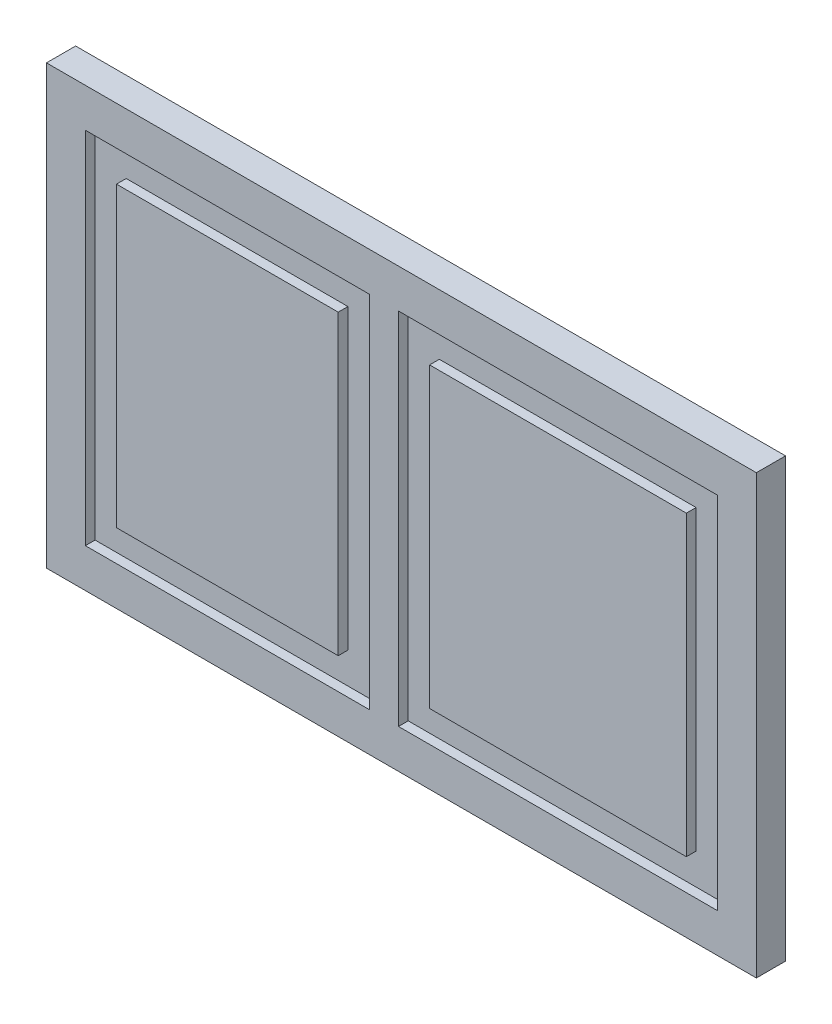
ISO-10303-21;
HEADER;
FILE_DESCRIPTION(('STEP AP214'),'2;1');
FILE_NAME('part.step','',(''),(''),'','','');
FILE_SCHEMA(('AUTOMOTIVE_DESIGN { 1 0 10303 214 1 1 1 1 }'));
ENDSEC;
DATA;
#1=APPLICATION_CONTEXT('core data for automotive mechanical design processes');
#2=APPLICATION_PROTOCOL_DEFINITION('international standard','automotive_design',2000,#1);
#3=PRODUCT_CONTEXT('',#1,'mechanical');
#4=PRODUCT('Part','Part','',(#3));
#5=PRODUCT_RELATED_PRODUCT_CATEGORY('part','',(#4));
#6=PRODUCT_DEFINITION_FORMATION('','',#4);
#7=PRODUCT_DEFINITION_CONTEXT('part definition',#1,'design');
#8=PRODUCT_DEFINITION('design','',#6,#7);
#9=PRODUCT_DEFINITION_SHAPE('','',#8);
#10=(LENGTH_UNIT() NAMED_UNIT(*) SI_UNIT(.MILLI.,.METRE.));
#11=(NAMED_UNIT(*) PLANE_ANGLE_UNIT() SI_UNIT($,.RADIAN.));
#12=(NAMED_UNIT(*) SI_UNIT($,.STERADIAN.) SOLID_ANGLE_UNIT());
#13=UNCERTAINTY_MEASURE_WITH_UNIT(LENGTH_MEASURE(1.E-05),#10,'distance_accuracy_value','');
#14=(GEOMETRIC_REPRESENTATION_CONTEXT(3) GLOBAL_UNCERTAINTY_ASSIGNED_CONTEXT((#13)) GLOBAL_UNIT_ASSIGNED_CONTEXT((#10,
#11,#12)) REPRESENTATION_CONTEXT('',''));
#15=CARTESIAN_POINT('',(0.,0.,0.));
#16=DIRECTION('',(0.,0.,1.));
#17=DIRECTION('',(1.,0.,0.));
#18=AXIS2_PLACEMENT_3D('',#15,#16,#17);
#19=CARTESIAN_POINT('',(-30.,40.,3.));
#20=DIRECTION('',(1.,0.,0.));
#21=DIRECTION('',(0.,0.,-1.));
#22=AXIS2_PLACEMENT_3D('',#19,#20,#21);
#23=PLANE('',#22);
#24=DIRECTION('',(0.,-1.,0.));
#25=VECTOR('',#24,1.);
#26=CARTESIAN_POINT('',(-30.,40.,0.));
#27=LINE('',#26,#25);
#28=CARTESIAN_POINT('',(-30.,40.,0.));
#29=VERTEX_POINT('',#28);
#30=CARTESIAN_POINT('',(-30.,-5.,0.));
#31=VERTEX_POINT('',#30);
#32=EDGE_CURVE('E289',#29,#31,#27,.T.);
#33=ORIENTED_EDGE('',*,*,#32,.T.);
#34=DIRECTION('',(0.,0.,-1.));
#35=VECTOR('',#34,1.);
#36=CARTESIAN_POINT('',(-30.,-5.,3.));
#37=LINE('',#36,#35);
#38=CARTESIAN_POINT('',(-30.,-5.,3.));
#39=VERTEX_POINT('',#38);
#40=EDGE_CURVE('E11',#39,#31,#37,.T.);
#41=ORIENTED_EDGE('',*,*,#40,.F.);
#42=DIRECTION('',(0.,-1.,0.));
#43=VECTOR('',#42,1.);
#44=CARTESIAN_POINT('',(-30.,40.,3.));
#45=LINE('',#44,#43);
#46=CARTESIAN_POINT('',(-30.,40.,3.));
#47=VERTEX_POINT('',#46);
#48=EDGE_CURVE('E304',#47,#39,#45,.T.);
#49=ORIENTED_EDGE('',*,*,#48,.F.);
#50=DIRECTION('',(0.,0.,-1.));
#51=VECTOR('',#50,1.);
#52=CARTESIAN_POINT('',(-30.,40.,3.));
#53=LINE('',#52,#51);
#54=EDGE_CURVE('E313',#47,#29,#53,.T.);
#55=ORIENTED_EDGE('',*,*,#54,.T.);
#56=EDGE_LOOP('',(#33,#41,#49,#55));
#57=FACE_BOUND('',#56,.T.);
#58=ADVANCED_FACE('F26',(#57),#23,.F.);
#59=CARTESIAN_POINT('',(-30.,-5.,3.));
#60=DIRECTION('',(0.,1.,0.));
#61=DIRECTION('',(0.,0.,1.));
#62=AXIS2_PLACEMENT_3D('',#59,#60,#61);
#63=PLANE('',#62);
#64=DIRECTION('',(1.,0.,0.));
#65=VECTOR('',#64,1.);
#66=CARTESIAN_POINT('',(-30.,-5.,0.));
#67=LINE('',#66,#65);
#68=CARTESIAN_POINT('',(43.,-5.,0.));
#69=VERTEX_POINT('',#68);
#70=EDGE_CURVE('E298',#31,#69,#67,.T.);
#71=ORIENTED_EDGE('',*,*,#70,.T.);
#72=DIRECTION('',(0.,0.,-1.));
#73=VECTOR('',#72,1.);
#74=CARTESIAN_POINT('',(43.,-5.,3.));
#75=LINE('',#74,#73);
#76=CARTESIAN_POINT('',(43.,-5.,3.));
#77=VERTEX_POINT('',#76);
#78=EDGE_CURVE('E33',#77,#69,#75,.T.);
#79=ORIENTED_EDGE('',*,*,#78,.F.);
#80=DIRECTION('',(1.,0.,0.));
#81=VECTOR('',#80,1.);
#82=CARTESIAN_POINT('',(-30.,-5.,3.));
#83=LINE('',#82,#81);
#84=EDGE_CURVE('E307',#39,#77,#83,.T.);
#85=ORIENTED_EDGE('',*,*,#84,.F.);
#86=ORIENTED_EDGE('',*,*,#40,.T.);
#87=EDGE_LOOP('',(#71,#79,#85,#86));
#88=FACE_BOUND('',#87,.T.);
#89=ADVANCED_FACE('F339',(#88),#63,.F.);
#90=CARTESIAN_POINT('',(43.,40.,3.));
#91=DIRECTION('',(-1.,0.,0.));
#92=DIRECTION('',(0.,-1.,0.));
#93=AXIS2_PLACEMENT_3D('',#90,#91,#92);
#94=PLANE('',#93);
#95=DIRECTION('',(0.,1.,0.));
#96=VECTOR('',#95,1.);
#97=CARTESIAN_POINT('',(43.,40.,0.));
#98=LINE('',#97,#96);
#99=CARTESIAN_POINT('',(43.,40.,0.));
#100=VERTEX_POINT('',#99);
#101=EDGE_CURVE('E300',#69,#100,#98,.T.);
#102=ORIENTED_EDGE('',*,*,#101,.T.);
#103=DIRECTION('',(0.,0.,-1.));
#104=VECTOR('',#103,1.);
#105=CARTESIAN_POINT('',(43.,40.,3.));
#106=LINE('',#105,#104);
#107=CARTESIAN_POINT('',(43.,40.,3.));
#108=VERTEX_POINT('',#107);
#109=EDGE_CURVE('E316',#108,#100,#106,.T.);
#110=ORIENTED_EDGE('',*,*,#109,.F.);
#111=DIRECTION('',(0.,1.,0.));
#112=VECTOR('',#111,1.);
#113=CARTESIAN_POINT('',(43.,40.,3.));
#114=LINE('',#113,#112);
#115=EDGE_CURVE('E309',#77,#108,#114,.T.);
#116=ORIENTED_EDGE('',*,*,#115,.F.);
#117=ORIENTED_EDGE('',*,*,#78,.T.);
#118=EDGE_LOOP('',(#102,#110,#116,#117));
#119=FACE_BOUND('',#118,.T.);
#120=ADVANCED_FACE('F323',(#119),#94,.F.);
#121=CARTESIAN_POINT('',(-30.,40.,3.));
#122=DIRECTION('',(0.,-1.,0.));
#123=DIRECTION('',(0.,0.,-1.));
#124=AXIS2_PLACEMENT_3D('',#121,#122,#123);
#125=PLANE('',#124);
#126=DIRECTION('',(-1.,0.,0.));
#127=VECTOR('',#126,1.);
#128=CARTESIAN_POINT('',(-30.,40.,0.));
#129=LINE('',#128,#127);
#130=EDGE_CURVE('E302',#100,#29,#129,.T.);
#131=ORIENTED_EDGE('',*,*,#130,.T.);
#132=ORIENTED_EDGE('',*,*,#54,.F.);
#133=DIRECTION('',(-1.,0.,0.));
#134=VECTOR('',#133,1.);
#135=CARTESIAN_POINT('',(-30.,40.,3.));
#136=LINE('',#135,#134);
#137=EDGE_CURVE('E311',#108,#47,#136,.T.);
#138=ORIENTED_EDGE('',*,*,#137,.F.);
#139=ORIENTED_EDGE('',*,*,#109,.T.);
#140=EDGE_LOOP('',(#131,#132,#138,#139));
#141=FACE_BOUND('',#140,.T.);
#142=ADVANCED_FACE('F332',(#141),#125,.F.);
#143=CARTESIAN_POINT('',(-30.,-5.,3.));
#144=DIRECTION('',(0.,0.,1.));
#145=DIRECTION('',(1.,0.,0.));
#146=AXIS2_PLACEMENT_3D('',#143,#144,#145);
#147=PLANE('',#146);
#148=DIRECTION('',(0.,1.,0.));
#149=VECTOR('',#148,1.);
#150=CARTESIAN_POINT('',(39.,36.,3.));
#151=LINE('',#150,#149);
#152=CARTESIAN_POINT('',(39.,-0.999999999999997,3.));
#153=VERTEX_POINT('',#152);
#154=CARTESIAN_POINT('',(39.,36.,3.));
#155=VERTEX_POINT('',#154);
#156=EDGE_CURVE('E40',#153,#155,#151,.T.);
#157=ORIENTED_EDGE('',*,*,#156,.F.);
#158=DIRECTION('',(1.,0.,0.));
#159=VECTOR('',#158,1.);
#160=CARTESIAN_POINT('',(39.,-0.999999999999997,3.));
#161=LINE('',#160,#159);
#162=CARTESIAN_POINT('',(6.20000000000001,-1.,3.));
#163=VERTEX_POINT('',#162);
#164=EDGE_CURVE('E207',#163,#153,#161,.T.);
#165=ORIENTED_EDGE('',*,*,#164,.F.);
#166=DIRECTION('',(0.,-1.,0.));
#167=VECTOR('',#166,1.);
#168=CARTESIAN_POINT('',(6.2,36.,3.));
#169=LINE('',#168,#167);
#170=CARTESIAN_POINT('',(6.2,36.,3.));
#171=VERTEX_POINT('',#170);
#172=EDGE_CURVE('E204',#171,#163,#169,.T.);
#173=ORIENTED_EDGE('',*,*,#172,.F.);
#174=DIRECTION('',(-1.,0.,0.));
#175=VECTOR('',#174,1.);
#176=CARTESIAN_POINT('',(39.,36.,3.));
#177=LINE('',#176,#175);
#178=EDGE_CURVE('E201',#155,#171,#177,.T.);
#179=ORIENTED_EDGE('',*,*,#178,.F.);
#180=EDGE_LOOP('',(#157,#165,#173,#179));
#181=FACE_BOUND('',#180,.T.);
#182=DIRECTION('',(0.,-1.,0.));
#183=VECTOR('',#182,1.);
#184=CARTESIAN_POINT('',(-26.,36.,3.));
#185=LINE('',#184,#183);
#186=CARTESIAN_POINT('',(-26.,36.,3.));
#187=VERTEX_POINT('',#186);
#188=CARTESIAN_POINT('',(-26.,-0.999999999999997,3.));
#189=VERTEX_POINT('',#188);
#190=EDGE_CURVE('E257',#187,#189,#185,.T.);
#191=ORIENTED_EDGE('',*,*,#190,.F.);
#192=DIRECTION('',(-1.,0.,0.));
#193=VECTOR('',#192,1.);
#194=CARTESIAN_POINT('',(-26.,36.,3.));
#195=LINE('',#194,#193);
#196=CARTESIAN_POINT('',(3.20000000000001,36.,3.));
#197=VERTEX_POINT('',#196);
#198=EDGE_CURVE('E271',#197,#187,#195,.T.);
#199=ORIENTED_EDGE('',*,*,#198,.F.);
#200=DIRECTION('',(0.,1.,0.));
#201=VECTOR('',#200,1.);
#202=CARTESIAN_POINT('',(3.20000000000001,36.,3.));
#203=LINE('',#202,#201);
#204=CARTESIAN_POINT('',(3.20000000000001,-1.,3.));
#205=VERTEX_POINT('',#204);
#206=EDGE_CURVE('E268',#205,#197,#203,.T.);
#207=ORIENTED_EDGE('',*,*,#206,.F.);
#208=DIRECTION('',(1.,0.,0.));
#209=VECTOR('',#208,1.);
#210=CARTESIAN_POINT('',(-26.,-0.999999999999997,3.));
#211=LINE('',#210,#209);
#212=EDGE_CURVE('E265',#189,#205,#211,.T.);
#213=ORIENTED_EDGE('',*,*,#212,.F.);
#214=EDGE_LOOP('',(#191,#199,#207,#213));
#215=FACE_BOUND('',#214,.T.);
#216=ORIENTED_EDGE('',*,*,#48,.T.);
#217=ORIENTED_EDGE('',*,*,#84,.T.);
#218=ORIENTED_EDGE('',*,*,#115,.T.);
#219=ORIENTED_EDGE('',*,*,#137,.T.);
#220=EDGE_LOOP('',(#216,#217,#218,#219));
#221=FACE_BOUND('',#220,.T.);
#222=ADVANCED_FACE('F338',(#181,#215,#221),#147,.T.);
#223=CARTESIAN_POINT('',(-30.,-5.,0.));
#224=DIRECTION('',(0.,0.,1.));
#225=DIRECTION('',(1.,0.,0.));
#226=AXIS2_PLACEMENT_3D('',#223,#224,#225);
#227=PLANE('',#226);
#228=ORIENTED_EDGE('',*,*,#32,.F.);
#229=ORIENTED_EDGE('',*,*,#130,.F.);
#230=ORIENTED_EDGE('',*,*,#101,.F.);
#231=ORIENTED_EDGE('',*,*,#70,.F.);
#232=EDGE_LOOP('',(#228,#229,#230,#231));
#233=FACE_BOUND('',#232,.T.);
#234=ADVANCED_FACE('F329',(#233),#227,.F.);
#235=CARTESIAN_POINT('',(-26.,36.,2.));
#236=DIRECTION('',(-1.,0.,0.));
#237=DIRECTION('',(0.,0.,1.));
#238=AXIS2_PLACEMENT_3D('',#235,#236,#237);
#239=PLANE('',#238);
#240=ORIENTED_EDGE('',*,*,#190,.T.);
#241=DIRECTION('',(0.,0.,1.));
#242=VECTOR('',#241,1.);
#243=CARTESIAN_POINT('',(-26.,-0.999999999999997,2.));
#244=LINE('',#243,#242);
#245=CARTESIAN_POINT('',(-26.,-0.999999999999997,2.));
#246=VERTEX_POINT('',#245);
#247=EDGE_CURVE('E286',#246,#189,#244,.T.);
#248=ORIENTED_EDGE('',*,*,#247,.F.);
#249=DIRECTION('',(0.,-1.,0.));
#250=VECTOR('',#249,1.);
#251=CARTESIAN_POINT('',(-26.,36.,2.));
#252=LINE('',#251,#250);
#253=CARTESIAN_POINT('',(-26.,36.,2.));
#254=VERTEX_POINT('',#253);
#255=EDGE_CURVE('E274',#254,#246,#252,.T.);
#256=ORIENTED_EDGE('',*,*,#255,.F.);
#257=DIRECTION('',(0.,0.,1.));
#258=VECTOR('',#257,1.);
#259=CARTESIAN_POINT('',(-26.,36.,2.));
#260=LINE('',#259,#258);
#261=EDGE_CURVE('E287',#254,#187,#260,.T.);
#262=ORIENTED_EDGE('',*,*,#261,.T.);
#263=EDGE_LOOP('',(#240,#248,#256,#262));
#264=FACE_BOUND('',#263,.T.);
#265=ADVANCED_FACE('F355',(#264),#239,.F.);
#266=CARTESIAN_POINT('',(-26.,36.,2.));
#267=DIRECTION('',(0.,1.,0.));
#268=DIRECTION('',(0.,0.,1.));
#269=AXIS2_PLACEMENT_3D('',#266,#267,#268);
#270=PLANE('',#269);
#271=ORIENTED_EDGE('',*,*,#198,.T.);
#272=ORIENTED_EDGE('',*,*,#261,.F.);
#273=DIRECTION('',(-1.,0.,0.));
#274=VECTOR('',#273,1.);
#275=CARTESIAN_POINT('',(-26.,36.,2.));
#276=LINE('',#275,#274);
#277=CARTESIAN_POINT('',(3.20000000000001,36.,2.));
#278=VERTEX_POINT('',#277);
#279=EDGE_CURVE('E283',#278,#254,#276,.T.);
#280=ORIENTED_EDGE('',*,*,#279,.F.);
#281=DIRECTION('',(0.,0.,1.));
#282=VECTOR('',#281,1.);
#283=CARTESIAN_POINT('',(3.20000000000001,36.,2.));
#284=LINE('',#283,#282);
#285=EDGE_CURVE('E290',#278,#197,#284,.T.);
#286=ORIENTED_EDGE('',*,*,#285,.T.);
#287=EDGE_LOOP('',(#271,#272,#280,#286));
#288=FACE_BOUND('',#287,.T.);
#289=ADVANCED_FACE('F358',(#288),#270,.F.);
#290=CARTESIAN_POINT('',(3.20000000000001,36.,2.));
#291=DIRECTION('',(1.,0.,0.));
#292=DIRECTION('',(0.,1.,0.));
#293=AXIS2_PLACEMENT_3D('',#290,#291,#292);
#294=PLANE('',#293);
#295=ORIENTED_EDGE('',*,*,#206,.T.);
#296=ORIENTED_EDGE('',*,*,#285,.F.);
#297=DIRECTION('',(0.,1.,0.));
#298=VECTOR('',#297,1.);
#299=CARTESIAN_POINT('',(3.20000000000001,36.,2.));
#300=LINE('',#299,#298);
#301=CARTESIAN_POINT('',(3.20000000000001,-1.,2.));
#302=VERTEX_POINT('',#301);
#303=EDGE_CURVE('E280',#302,#278,#300,.T.);
#304=ORIENTED_EDGE('',*,*,#303,.F.);
#305=DIRECTION('',(0.,0.,1.));
#306=VECTOR('',#305,1.);
#307=CARTESIAN_POINT('',(3.20000000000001,-1.,2.));
#308=LINE('',#307,#306);
#309=EDGE_CURVE('E292',#302,#205,#308,.T.);
#310=ORIENTED_EDGE('',*,*,#309,.T.);
#311=EDGE_LOOP('',(#295,#296,#304,#310));
#312=FACE_BOUND('',#311,.T.);
#313=ADVANCED_FACE('F364',(#312),#294,.F.);
#314=CARTESIAN_POINT('',(-26.,-0.999999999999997,2.));
#315=DIRECTION('',(0.,-1.,0.));
#316=DIRECTION('',(1.,0.,0.));
#317=AXIS2_PLACEMENT_3D('',#314,#315,#316);
#318=PLANE('',#317);
#319=ORIENTED_EDGE('',*,*,#212,.T.);
#320=ORIENTED_EDGE('',*,*,#309,.F.);
#321=DIRECTION('',(1.,0.,0.));
#322=VECTOR('',#321,1.);
#323=CARTESIAN_POINT('',(-26.,-0.999999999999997,2.));
#324=LINE('',#323,#322);
#325=EDGE_CURVE('E277',#246,#302,#324,.T.);
#326=ORIENTED_EDGE('',*,*,#325,.F.);
#327=ORIENTED_EDGE('',*,*,#247,.T.);
#328=EDGE_LOOP('',(#319,#320,#326,#327));
#329=FACE_BOUND('',#328,.T.);
#330=ADVANCED_FACE('F360',(#329),#318,.F.);
#331=CARTESIAN_POINT('',(-26.,36.,2.));
#332=DIRECTION('',(0.,0.,1.));
#333=DIRECTION('',(1.,0.,0.));
#334=AXIS2_PLACEMENT_3D('',#331,#332,#333);
#335=PLANE('',#334);
#336=DIRECTION('',(-1.,0.,0.));
#337=VECTOR('',#336,1.);
#338=CARTESIAN_POINT('',(-22.8,32.8,2.));
#339=LINE('',#338,#337);
#340=CARTESIAN_POINT('',(0.,32.8,2.));
#341=VERTEX_POINT('',#340);
#342=CARTESIAN_POINT('',(-22.8,32.8,2.));
#343=VERTEX_POINT('',#342);
#344=EDGE_CURVE('E251',#341,#343,#339,.T.);
#345=ORIENTED_EDGE('',*,*,#344,.F.);
#346=DIRECTION('',(0.,1.,0.));
#347=VECTOR('',#346,1.);
#348=CARTESIAN_POINT('',(0.,32.8,2.));
#349=LINE('',#348,#347);
#350=CARTESIAN_POINT('',(0.,2.2,2.));
#351=VERTEX_POINT('',#350);
#352=EDGE_CURVE('E248',#351,#341,#349,.T.);
#353=ORIENTED_EDGE('',*,*,#352,.F.);
#354=DIRECTION('',(1.,0.,0.));
#355=VECTOR('',#354,1.);
#356=CARTESIAN_POINT('',(-22.8,2.2,2.));
#357=LINE('',#356,#355);
#358=CARTESIAN_POINT('',(-22.8,2.2,2.));
#359=VERTEX_POINT('',#358);
#360=EDGE_CURVE('E245',#359,#351,#357,.T.);
#361=ORIENTED_EDGE('',*,*,#360,.F.);
#362=DIRECTION('',(0.,-1.,0.));
#363=VECTOR('',#362,1.);
#364=CARTESIAN_POINT('',(-22.8,32.8,2.));
#365=LINE('',#364,#363);
#366=EDGE_CURVE('E242',#343,#359,#365,.T.);
#367=ORIENTED_EDGE('',*,*,#366,.F.);
#368=EDGE_LOOP('',(#345,#353,#361,#367));
#369=FACE_BOUND('',#368,.T.);
#370=ORIENTED_EDGE('',*,*,#255,.T.);
#371=ORIENTED_EDGE('',*,*,#325,.T.);
#372=ORIENTED_EDGE('',*,*,#303,.T.);
#373=ORIENTED_EDGE('',*,*,#279,.T.);
#374=EDGE_LOOP('',(#370,#371,#372,#373));
#375=FACE_BOUND('',#374,.T.);
#376=ADVANCED_FACE('F363',(#369,#375),#335,.T.);
#377=CARTESIAN_POINT('',(-22.8,32.8,2.));
#378=DIRECTION('',(-1.,0.,0.));
#379=DIRECTION('',(0.,-1.,0.));
#380=AXIS2_PLACEMENT_3D('',#377,#378,#379);
#381=PLANE('',#380);
#382=DIRECTION('',(0.,-1.,0.));
#383=VECTOR('',#382,1.);
#384=CARTESIAN_POINT('',(-22.8,32.8,3.));
#385=LINE('',#384,#383);
#386=CARTESIAN_POINT('',(-22.8,32.8,3.));
#387=VERTEX_POINT('',#386);
#388=CARTESIAN_POINT('',(-22.8,2.2,3.));
#389=VERTEX_POINT('',#388);
#390=EDGE_CURVE('E225',#387,#389,#385,.T.);
#391=ORIENTED_EDGE('',*,*,#390,.F.);
#392=DIRECTION('',(0.,0.,1.));
#393=VECTOR('',#392,1.);
#394=CARTESIAN_POINT('',(-22.8,32.8,2.));
#395=LINE('',#394,#393);
#396=EDGE_CURVE('E255',#343,#387,#395,.T.);
#397=ORIENTED_EDGE('',*,*,#396,.F.);
#398=ORIENTED_EDGE('',*,*,#366,.T.);
#399=DIRECTION('',(0.,0.,1.));
#400=VECTOR('',#399,1.);
#401=CARTESIAN_POINT('',(-22.8,2.2,2.));
#402=LINE('',#401,#400);
#403=EDGE_CURVE('E254',#359,#389,#402,.T.);
#404=ORIENTED_EDGE('',*,*,#403,.T.);
#405=EDGE_LOOP('',(#391,#397,#398,#404));
#406=FACE_BOUND('',#405,.T.);
#407=ADVANCED_FACE('F374',(#406),#381,.T.);
#408=CARTESIAN_POINT('',(-22.8,32.8,2.));
#409=DIRECTION('',(0.,1.,0.));
#410=DIRECTION('',(0.,0.,1.));
#411=AXIS2_PLACEMENT_3D('',#408,#409,#410);
#412=PLANE('',#411);
#413=DIRECTION('',(-1.,0.,0.));
#414=VECTOR('',#413,1.);
#415=CARTESIAN_POINT('',(-22.8,32.8,3.));
#416=LINE('',#415,#414);
#417=CARTESIAN_POINT('',(0.,32.8,3.));
#418=VERTEX_POINT('',#417);
#419=EDGE_CURVE('E239',#418,#387,#416,.T.);
#420=ORIENTED_EDGE('',*,*,#419,.F.);
#421=DIRECTION('',(0.,0.,1.));
#422=VECTOR('',#421,1.);
#423=CARTESIAN_POINT('',(0.,32.8,2.));
#424=LINE('',#423,#422);
#425=EDGE_CURVE('E258',#341,#418,#424,.T.);
#426=ORIENTED_EDGE('',*,*,#425,.F.);
#427=ORIENTED_EDGE('',*,*,#344,.T.);
#428=ORIENTED_EDGE('',*,*,#396,.T.);
#429=EDGE_LOOP('',(#420,#426,#427,#428));
#430=FACE_BOUND('',#429,.T.);
#431=ADVANCED_FACE('F378',(#430),#412,.T.);
#432=CARTESIAN_POINT('',(0.,32.8,2.));
#433=DIRECTION('',(1.,0.,0.));
#434=DIRECTION('',(0.,1.,0.));
#435=AXIS2_PLACEMENT_3D('',#432,#433,#434);
#436=PLANE('',#435);
#437=DIRECTION('',(0.,1.,0.));
#438=VECTOR('',#437,1.);
#439=CARTESIAN_POINT('',(0.,32.8,3.));
#440=LINE('',#439,#438);
#441=CARTESIAN_POINT('',(0.,2.2,3.));
#442=VERTEX_POINT('',#441);
#443=EDGE_CURVE('E236',#442,#418,#440,.T.);
#444=ORIENTED_EDGE('',*,*,#443,.F.);
#445=DIRECTION('',(0.,0.,1.));
#446=VECTOR('',#445,1.);
#447=CARTESIAN_POINT('',(0.,2.2,2.));
#448=LINE('',#447,#446);
#449=EDGE_CURVE('E260',#351,#442,#448,.T.);
#450=ORIENTED_EDGE('',*,*,#449,.F.);
#451=ORIENTED_EDGE('',*,*,#352,.T.);
#452=ORIENTED_EDGE('',*,*,#425,.T.);
#453=EDGE_LOOP('',(#444,#450,#451,#452));
#454=FACE_BOUND('',#453,.T.);
#455=ADVANCED_FACE('F383',(#454),#436,.T.);
#456=CARTESIAN_POINT('',(-22.8,2.2,2.));
#457=DIRECTION('',(0.,-1.,0.));
#458=DIRECTION('',(1.,0.,0.));
#459=AXIS2_PLACEMENT_3D('',#456,#457,#458);
#460=PLANE('',#459);
#461=DIRECTION('',(1.,0.,0.));
#462=VECTOR('',#461,1.);
#463=CARTESIAN_POINT('',(-22.8,2.2,3.));
#464=LINE('',#463,#462);
#465=EDGE_CURVE('E233',#389,#442,#464,.T.);
#466=ORIENTED_EDGE('',*,*,#465,.F.);
#467=ORIENTED_EDGE('',*,*,#403,.F.);
#468=ORIENTED_EDGE('',*,*,#360,.T.);
#469=ORIENTED_EDGE('',*,*,#449,.T.);
#470=EDGE_LOOP('',(#466,#467,#468,#469));
#471=FACE_BOUND('',#470,.T.);
#472=ADVANCED_FACE('F380',(#471),#460,.T.);
#473=ORIENTED_EDGE('',*,*,#419,.T.);
#474=ORIENTED_EDGE('',*,*,#390,.T.);
#475=ORIENTED_EDGE('',*,*,#465,.T.);
#476=ORIENTED_EDGE('',*,*,#443,.T.);
#477=EDGE_LOOP('',(#473,#474,#475,#476));
#478=FACE_BOUND('',#477,.T.);
#479=ADVANCED_FACE('F352',(#478),#147,.T.);
#480=CARTESIAN_POINT('',(39.,36.,2.));
#481=DIRECTION('',(1.,0.,0.));
#482=DIRECTION('',(0.,1.,0.));
#483=AXIS2_PLACEMENT_3D('',#480,#481,#482);
#484=PLANE('',#483);
#485=ORIENTED_EDGE('',*,*,#156,.T.);
#486=DIRECTION('',(0.,0.,1.));
#487=VECTOR('',#486,1.);
#488=CARTESIAN_POINT('',(39.,36.,2.));
#489=LINE('',#488,#487);
#490=CARTESIAN_POINT('',(39.,36.,2.));
#491=VERTEX_POINT('',#490);
#492=EDGE_CURVE('E222',#491,#155,#489,.T.);
#493=ORIENTED_EDGE('',*,*,#492,.F.);
#494=DIRECTION('',(0.,1.,0.));
#495=VECTOR('',#494,1.);
#496=CARTESIAN_POINT('',(39.,36.,2.));
#497=LINE('',#496,#495);
#498=CARTESIAN_POINT('',(39.,-0.999999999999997,2.));
#499=VERTEX_POINT('',#498);
#500=EDGE_CURVE('E210',#499,#491,#497,.T.);
#501=ORIENTED_EDGE('',*,*,#500,.F.);
#502=DIRECTION('',(0.,0.,1.));
#503=VECTOR('',#502,1.);
#504=CARTESIAN_POINT('',(39.,-0.999999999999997,2.));
#505=LINE('',#504,#503);
#506=EDGE_CURVE('E223',#499,#153,#505,.T.);
#507=ORIENTED_EDGE('',*,*,#506,.T.);
#508=EDGE_LOOP('',(#485,#493,#501,#507));
#509=FACE_BOUND('',#508,.T.);
#510=ADVANCED_FACE('F391',(#509),#484,.F.);
#511=CARTESIAN_POINT('',(39.,-0.999999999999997,2.));
#512=DIRECTION('',(0.,-1.,0.));
#513=DIRECTION('',(1.,0.,0.));
#514=AXIS2_PLACEMENT_3D('',#511,#512,#513);
#515=PLANE('',#514);
#516=ORIENTED_EDGE('',*,*,#164,.T.);
#517=ORIENTED_EDGE('',*,*,#506,.F.);
#518=DIRECTION('',(1.,0.,0.));
#519=VECTOR('',#518,1.);
#520=CARTESIAN_POINT('',(39.,-0.999999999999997,2.));
#521=LINE('',#520,#519);
#522=CARTESIAN_POINT('',(6.20000000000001,-1.,2.));
#523=VERTEX_POINT('',#522);
#524=EDGE_CURVE('E219',#523,#499,#521,.T.);
#525=ORIENTED_EDGE('',*,*,#524,.F.);
#526=DIRECTION('',(0.,0.,1.));
#527=VECTOR('',#526,1.);
#528=CARTESIAN_POINT('',(6.20000000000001,-1.,2.));
#529=LINE('',#528,#527);
#530=EDGE_CURVE('E226',#523,#163,#529,.T.);
#531=ORIENTED_EDGE('',*,*,#530,.T.);
#532=EDGE_LOOP('',(#516,#517,#525,#531));
#533=FACE_BOUND('',#532,.T.);
#534=ADVANCED_FACE('F394',(#533),#515,.F.);
#535=CARTESIAN_POINT('',(6.2,36.,2.));
#536=DIRECTION('',(-1.,0.,0.));
#537=DIRECTION('',(0.,-1.,0.));
#538=AXIS2_PLACEMENT_3D('',#535,#536,#537);
#539=PLANE('',#538);
#540=ORIENTED_EDGE('',*,*,#172,.T.);
#541=ORIENTED_EDGE('',*,*,#530,.F.);
#542=DIRECTION('',(0.,-1.,0.));
#543=VECTOR('',#542,1.);
#544=CARTESIAN_POINT('',(6.2,36.,2.));
#545=LINE('',#544,#543);
#546=CARTESIAN_POINT('',(6.2,36.,2.));
#547=VERTEX_POINT('',#546);
#548=EDGE_CURVE('E216',#547,#523,#545,.T.);
#549=ORIENTED_EDGE('',*,*,#548,.F.);
#550=DIRECTION('',(0.,0.,1.));
#551=VECTOR('',#550,1.);
#552=CARTESIAN_POINT('',(6.2,36.,2.));
#553=LINE('',#552,#551);
#554=EDGE_CURVE('E228',#547,#171,#553,.T.);
#555=ORIENTED_EDGE('',*,*,#554,.T.);
#556=EDGE_LOOP('',(#540,#541,#549,#555));
#557=FACE_BOUND('',#556,.T.);
#558=ADVANCED_FACE('F399',(#557),#539,.F.);
#559=CARTESIAN_POINT('',(39.,36.,2.));
#560=DIRECTION('',(0.,1.,0.));
#561=DIRECTION('',(-1.,0.,0.));
#562=AXIS2_PLACEMENT_3D('',#559,#560,#561);
#563=PLANE('',#562);
#564=ORIENTED_EDGE('',*,*,#178,.T.);
#565=ORIENTED_EDGE('',*,*,#554,.F.);
#566=DIRECTION('',(-1.,0.,0.));
#567=VECTOR('',#566,1.);
#568=CARTESIAN_POINT('',(39.,36.,2.));
#569=LINE('',#568,#567);
#570=EDGE_CURVE('E213',#491,#547,#569,.T.);
#571=ORIENTED_EDGE('',*,*,#570,.F.);
#572=ORIENTED_EDGE('',*,*,#492,.T.);
#573=EDGE_LOOP('',(#564,#565,#571,#572));
#574=FACE_BOUND('',#573,.T.);
#575=ADVANCED_FACE('F395',(#574),#563,.F.);
#576=CARTESIAN_POINT('',(39.,36.,2.));
#577=DIRECTION('',(0.,0.,-1.));
#578=DIRECTION('',(-1.,0.,0.));
#579=AXIS2_PLACEMENT_3D('',#576,#577,#578);
#580=PLANE('',#579);
#581=DIRECTION('',(0.,-1.,0.));
#582=VECTOR('',#581,1.);
#583=CARTESIAN_POINT('',(9.4,32.8,2.));
#584=LINE('',#583,#582);
#585=CARTESIAN_POINT('',(9.4,32.8,2.));
#586=VERTEX_POINT('',#585);
#587=CARTESIAN_POINT('',(9.40000000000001,2.2,2.));
#588=VERTEX_POINT('',#587);
#589=EDGE_CURVE('E177',#586,#588,#584,.T.);
#590=ORIENTED_EDGE('',*,*,#589,.F.);
#591=DIRECTION('',(-1.,0.,0.));
#592=VECTOR('',#591,1.);
#593=CARTESIAN_POINT('',(9.4,32.8,2.));
#594=LINE('',#593,#592);
#595=CARTESIAN_POINT('',(35.8,32.8,2.));
#596=VERTEX_POINT('',#595);
#597=EDGE_CURVE('E194',#596,#586,#594,.T.);
#598=ORIENTED_EDGE('',*,*,#597,.F.);
#599=DIRECTION('',(0.,1.,0.));
#600=VECTOR('',#599,1.);
#601=CARTESIAN_POINT('',(35.8,32.8,2.));
#602=LINE('',#601,#600);
#603=CARTESIAN_POINT('',(35.8,2.2,2.));
#604=VERTEX_POINT('',#603);
#605=EDGE_CURVE('E164',#604,#596,#602,.T.);
#606=ORIENTED_EDGE('',*,*,#605,.F.);
#607=DIRECTION('',(1.,0.,0.));
#608=VECTOR('',#607,1.);
#609=CARTESIAN_POINT('',(9.40000000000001,2.2,2.));
#610=LINE('',#609,#608);
#611=EDGE_CURVE('E190',#588,#604,#610,.T.);
#612=ORIENTED_EDGE('',*,*,#611,.F.);
#613=EDGE_LOOP('',(#590,#598,#606,#612));
#614=FACE_BOUND('',#613,.T.);
#615=ORIENTED_EDGE('',*,*,#500,.T.);
#616=ORIENTED_EDGE('',*,*,#570,.T.);
#617=ORIENTED_EDGE('',*,*,#548,.T.);
#618=ORIENTED_EDGE('',*,*,#524,.T.);
#619=EDGE_LOOP('',(#615,#616,#617,#618));
#620=FACE_BOUND('',#619,.T.);
#621=ADVANCED_FACE('F398',(#614,#620),#580,.F.);
#622=CARTESIAN_POINT('',(9.4,32.8,2.));
#623=DIRECTION('',(-1.,0.,0.));
#624=DIRECTION('',(0.,-1.,0.));
#625=AXIS2_PLACEMENT_3D('',#622,#623,#624);
#626=PLANE('',#625);
#627=DIRECTION('',(0.,-1.,0.));
#628=VECTOR('',#627,1.);
#629=CARTESIAN_POINT('',(9.4,32.8,3.));
#630=LINE('',#629,#628);
#631=CARTESIAN_POINT('',(9.4,32.8,3.));
#632=VERTEX_POINT('',#631);
#633=CARTESIAN_POINT('',(9.40000000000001,2.2,3.));
#634=VERTEX_POINT('',#633);
#635=EDGE_CURVE('E184',#632,#634,#630,.T.);
#636=ORIENTED_EDGE('',*,*,#635,.F.);
#637=DIRECTION('',(0.,0.,1.));
#638=VECTOR('',#637,1.);
#639=CARTESIAN_POINT('',(9.4,32.8,2.));
#640=LINE('',#639,#638);
#641=EDGE_CURVE('E168',#586,#632,#640,.T.);
#642=ORIENTED_EDGE('',*,*,#641,.F.);
#643=ORIENTED_EDGE('',*,*,#589,.T.);
#644=DIRECTION('',(0.,0.,1.));
#645=VECTOR('',#644,1.);
#646=CARTESIAN_POINT('',(9.40000000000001,2.2,2.));
#647=LINE('',#646,#645);
#648=EDGE_CURVE('E196',#588,#634,#647,.T.);
#649=ORIENTED_EDGE('',*,*,#648,.T.);
#650=EDGE_LOOP('',(#636,#642,#643,#649));
#651=FACE_BOUND('',#650,.T.);
#652=ADVANCED_FACE('F409',(#651),#626,.T.);
#653=CARTESIAN_POINT('',(9.4,32.8,2.));
#654=DIRECTION('',(0.,1.,0.));
#655=DIRECTION('',(-1.,0.,0.));
#656=AXIS2_PLACEMENT_3D('',#653,#654,#655);
#657=PLANE('',#656);
#658=DIRECTION('',(-1.,0.,0.));
#659=VECTOR('',#658,1.);
#660=CARTESIAN_POINT('',(9.4,32.8,3.));
#661=LINE('',#660,#659);
#662=CARTESIAN_POINT('',(35.8,32.8,3.));
#663=VERTEX_POINT('',#662);
#664=EDGE_CURVE('E172',#663,#632,#661,.T.);
#665=ORIENTED_EDGE('',*,*,#664,.F.);
#666=DIRECTION('',(0.,0.,1.));
#667=VECTOR('',#666,1.);
#668=CARTESIAN_POINT('',(35.8,32.8,2.));
#669=LINE('',#668,#667);
#670=EDGE_CURVE('E161',#596,#663,#669,.T.);
#671=ORIENTED_EDGE('',*,*,#670,.F.);
#672=ORIENTED_EDGE('',*,*,#597,.T.);
#673=ORIENTED_EDGE('',*,*,#641,.T.);
#674=EDGE_LOOP('',(#665,#671,#672,#673));
#675=FACE_BOUND('',#674,.T.);
#676=ADVANCED_FACE('F173',(#675),#657,.T.);
#677=CARTESIAN_POINT('',(35.8,32.8,2.));
#678=DIRECTION('',(1.,0.,0.));
#679=DIRECTION('',(0.,1.,0.));
#680=AXIS2_PLACEMENT_3D('',#677,#678,#679);
#681=PLANE('',#680);
#682=DIRECTION('',(0.,1.,0.));
#683=VECTOR('',#682,1.);
#684=CARTESIAN_POINT('',(35.8,32.8,3.));
#685=LINE('',#684,#683);
#686=CARTESIAN_POINT('',(35.8,2.2,3.));
#687=VERTEX_POINT('',#686);
#688=EDGE_CURVE('E48',#687,#663,#685,.T.);
#689=ORIENTED_EDGE('',*,*,#688,.F.);
#690=DIRECTION('',(0.,0.,1.));
#691=VECTOR('',#690,1.);
#692=CARTESIAN_POINT('',(35.8,2.2,2.));
#693=LINE('',#692,#691);
#694=EDGE_CURVE('E169',#604,#687,#693,.T.);
#695=ORIENTED_EDGE('',*,*,#694,.F.);
#696=ORIENTED_EDGE('',*,*,#605,.T.);
#697=ORIENTED_EDGE('',*,*,#670,.T.);
#698=EDGE_LOOP('',(#689,#695,#696,#697));
#699=FACE_BOUND('',#698,.T.);
#700=ADVANCED_FACE('F163',(#699),#681,.T.);
#701=CARTESIAN_POINT('',(9.40000000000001,2.2,2.));
#702=DIRECTION('',(0.,-1.,0.));
#703=DIRECTION('',(1.,0.,0.));
#704=AXIS2_PLACEMENT_3D('',#701,#702,#703);
#705=PLANE('',#704);
#706=DIRECTION('',(1.,0.,0.));
#707=VECTOR('',#706,1.);
#708=CARTESIAN_POINT('',(9.40000000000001,2.2,3.));
#709=LINE('',#708,#707);
#710=EDGE_CURVE('E182',#634,#687,#709,.T.);
#711=ORIENTED_EDGE('',*,*,#710,.F.);
#712=ORIENTED_EDGE('',*,*,#648,.F.);
#713=ORIENTED_EDGE('',*,*,#611,.T.);
#714=ORIENTED_EDGE('',*,*,#694,.T.);
#715=EDGE_LOOP('',(#711,#712,#713,#714));
#716=FACE_BOUND('',#715,.T.);
#717=ADVANCED_FACE('F414',(#716),#705,.T.);
#718=ORIENTED_EDGE('',*,*,#664,.T.);
#719=ORIENTED_EDGE('',*,*,#635,.T.);
#720=ORIENTED_EDGE('',*,*,#710,.T.);
#721=ORIENTED_EDGE('',*,*,#688,.T.);
#722=EDGE_LOOP('',(#718,#719,#720,#721));
#723=FACE_BOUND('',#722,.T.);
#724=ADVANCED_FACE('F180',(#723),#147,.T.);
#725=CLOSED_SHELL('',(#58,#89,#120,#142,#222,#234,#265,#289,#313,#330,#376,#407,#431,#455,#472,
#479,#510,#534,#558,#575,#621,#652,#676,#700,#717,#724));
#726=MANIFOLD_SOLID_BREP('B2',#725);
#727=ADVANCED_BREP_SHAPE_REPRESENTATION('',(#18,#726),#14);
#728=SHAPE_DEFINITION_REPRESENTATION(#9,#727);
ENDSEC;
END-ISO-10303-21;
